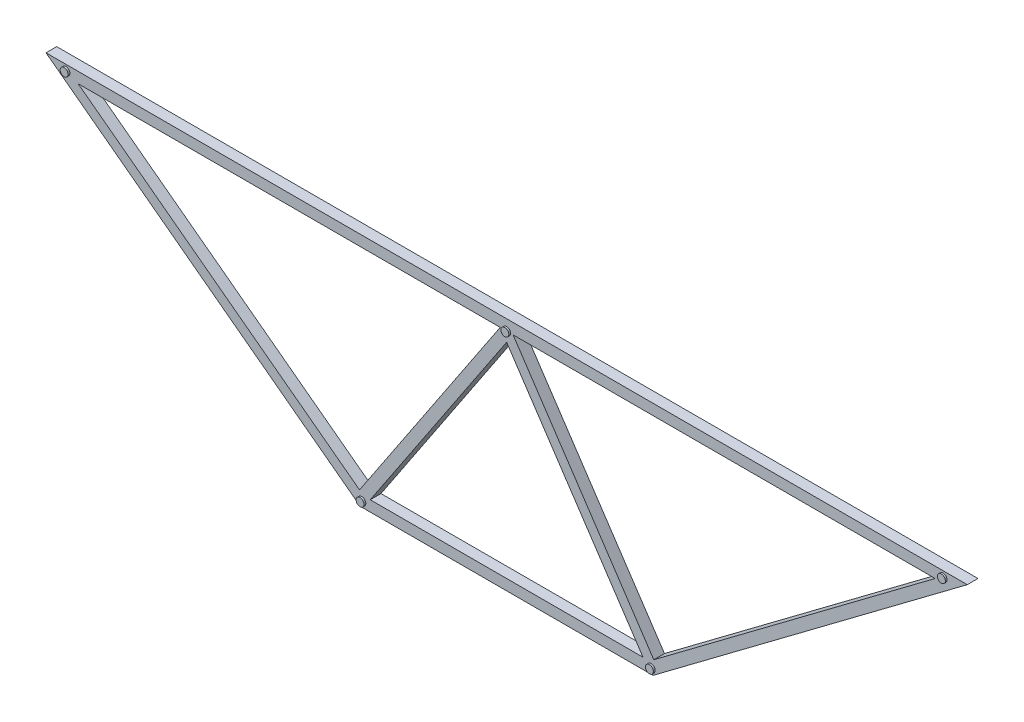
from build123d import *

# Parameters (mm, degrees)
TRUSS_BODY_DEPTH            = 15
SKETCH25_R                  = 5.555
PIN_HOLES_DEPTH             = 1285.318885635
BOSS_EXTRUDE10_DEPTH        = 2.5
BOSS_EXTRUDE10_DEPTH_BACK   = 17.5
SKETCH29_R                  = 5.555
BOSS_EXTRUDE10_2_DEPTH      = 2.5
BOSS_EXTRUDE10_2_DEPTH_BACK = 17.5
BOSS_EXTRUDE10_3_DEPTH      = 2.5
BOSS_EXTRUDE10_3_DEPTH_BACK = 17.5
BOSS_EXTRUDE10_4_DEPTH      = 2.5
BOSS_EXTRUDE10_4_DEPTH_BACK = 17.5
BOSS_EXTRUDE10_5_DEPTH      = 2.5
BOSS_EXTRUDE10_5_DEPTH_BACK = 17.5


with BuildPart() as part:
    # Sketch22 → Truss Body (new body)
    # profile 1 of 2: a face of its own
    with BuildSketch(Plane.XY):
        Polygon((-45, 15), (395, -315), (805, -315), (1245, 15), (600, 15), align=None)
        Polygon((600, 0), (1200, 0), (800, -300), (400, -300), (0, 0), align=None, mode=Mode.SUBTRACT)
    # profile 2 of 2: a face of its own
    with BuildSketch(Plane.XY):
        Polygon((600, 0), (590.986121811, 0), (393.990747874, -295.493060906), (400, -300), (409.013878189, -300), (600, -13.520817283), (790.986121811, -300), (800, -300), (806.009252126, -295.493060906), (609.013878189, 0), align=None)
    extrude(amount=TRUSS_BODY_DEPTH)

    # Sketch25 → Pin Holes (cut, through all)
    with BuildSketch(Plane.XY.offset(15)):
        with Locations((-17.115239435, 6.712760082)):
            Circle(SKETCH25_R)
        with Locations((397.256799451, -307.553177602)):
            Circle(SKETCH25_R)
        with Locations((802.394900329, -307.553177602)):
            Circle(SKETCH25_R)
        with Locations((1211.207349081, 6.712760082)):
            Circle(SKETCH25_R)
        with Locations((600, 0)):
            Circle(SKETCH25_R)
    extrude(amount=-PIN_HOLES_DEPTH, mode=Mode.SUBTRACT)


with BuildPart() as body_2:
    # Sketch29 → Boss-Extrude10 (new, two sides: drawn at the far end of the back side and taken through both)
    with BuildSketch(Plane.XY.offset(15).offset(-BOSS_EXTRUDE10_DEPTH_BACK)):
        with Locations((-17.115239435, 6.712760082)):
            Circle(SKETCH29_R)
    extrude(amount=BOSS_EXTRUDE10_DEPTH + BOSS_EXTRUDE10_DEPTH_BACK)


with BuildPart() as body_3:
    # Sketch29 → Boss-Extrude10 2 (new, two sides: drawn at the far end of the back side and taken through both)
    with BuildSketch(Plane.XY.offset(15).offset(-BOSS_EXTRUDE10_2_DEPTH_BACK)):
        with Locations((397.256799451, -307.553177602)):
            Circle(SKETCH29_R)
    extrude(amount=BOSS_EXTRUDE10_2_DEPTH + BOSS_EXTRUDE10_2_DEPTH_BACK)


with BuildPart() as body_4:
    # Sketch29 → Boss-Extrude10 3 (new, two sides: drawn at the far end of the back side and taken through both)
    with BuildSketch(Plane.XY.offset(15).offset(-BOSS_EXTRUDE10_3_DEPTH_BACK)):
        with Locations((802.394900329, -307.553177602)):
            Circle(SKETCH29_R)
    extrude(amount=BOSS_EXTRUDE10_3_DEPTH + BOSS_EXTRUDE10_3_DEPTH_BACK)


with BuildPart() as body_5:
    # Sketch29 → Boss-Extrude10 4 (new, two sides: drawn at the far end of the back side and taken through both)
    with BuildSketch(Plane.XY.offset(15).offset(-BOSS_EXTRUDE10_4_DEPTH_BACK)):
        with Locations((1211.207349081, 6.712760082)):
            Circle(SKETCH29_R)
    extrude(amount=BOSS_EXTRUDE10_4_DEPTH + BOSS_EXTRUDE10_4_DEPTH_BACK)


with BuildPart() as body_6:
    # Sketch29 → Boss-Extrude10 5 (new, two sides: drawn at the far end of the back side and taken through both)
    with BuildSketch(Plane.XY.offset(15).offset(-BOSS_EXTRUDE10_5_DEPTH_BACK)):
        with Locations((600, 0)):
            Circle(SKETCH29_R)
    extrude(amount=BOSS_EXTRUDE10_5_DEPTH + BOSS_EXTRUDE10_5_DEPTH_BACK)


solid = Compound([part.part, body_2.part, body_3.part, body_4.part, body_5.part, body_6.part])
